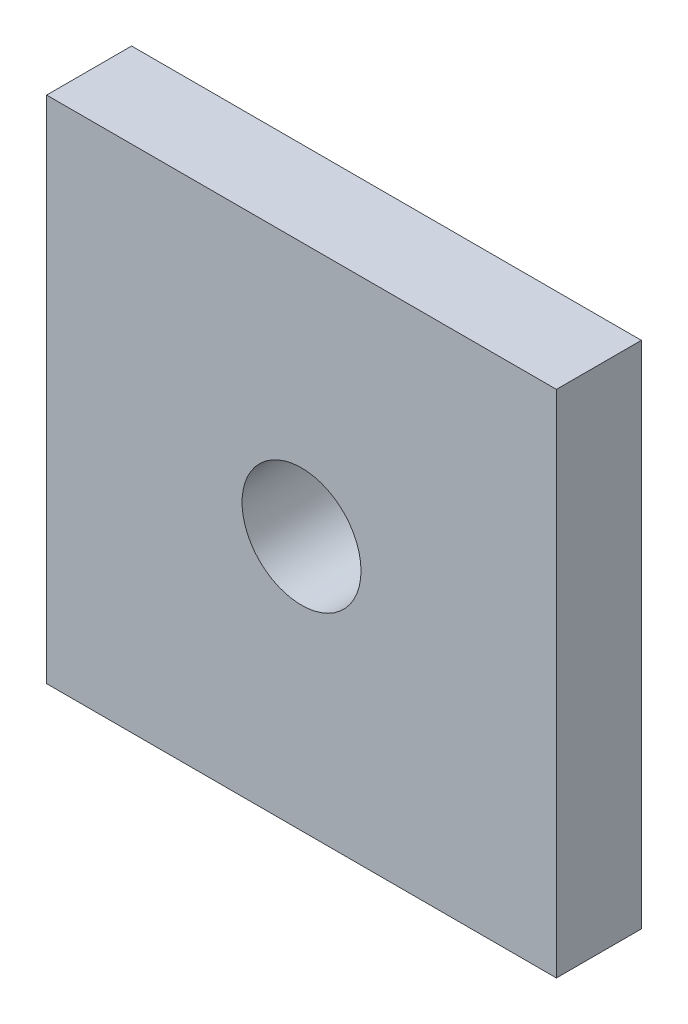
from build123d import *

# Parameters (mm, degrees)
SKIZZE1_W                       = 60
SKIZZE1_H                       = 60
AUFSATZ_LINEAR_AUSTRAGEN1_DEPTH = 10
SKIZZE2_R                       = 7
SCHNITT_LINEAR_AUSTRAGEN1_DEPTH = 10


with BuildPart() as part:
    # Skizze1 → Aufsatz-Linear austragen1 (new body)
    with BuildSketch(Plane.XY):
        with Locations((30, 30)):
            Rectangle(SKIZZE1_W, SKIZZE1_H)
    extrude(amount=AUFSATZ_LINEAR_AUSTRAGEN1_DEPTH)

    # Skizze2 → Schnitt-Linear austragen1 (cut)
    with BuildSketch(Plane.XY.offset(10)):
        with Locations((30, 30)):
            Circle(SKIZZE2_R)
    extrude(amount=-SCHNITT_LINEAR_AUSTRAGEN1_DEPTH, mode=Mode.SUBTRACT)


solid = part.part
